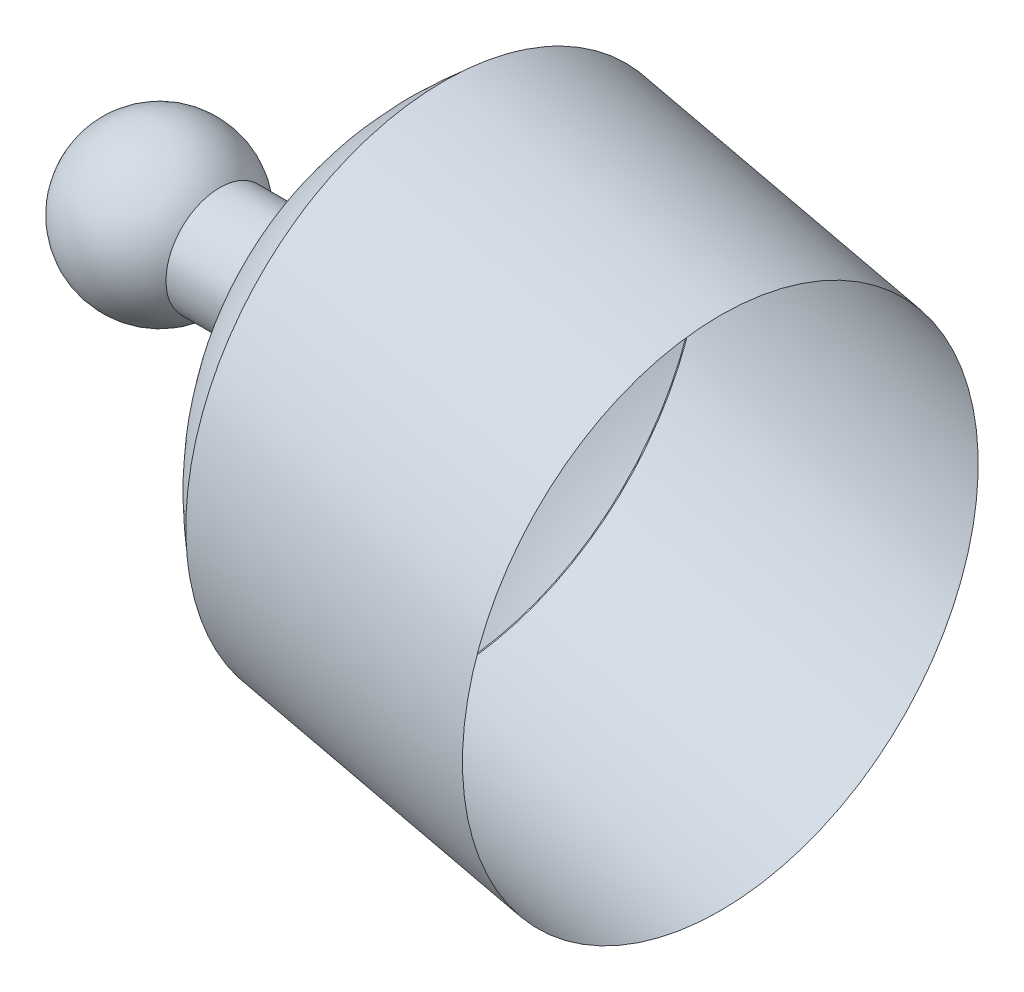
ISO-10303-21;
HEADER;
FILE_DESCRIPTION(('STEP AP214'),'2;1');
FILE_NAME('part.step','',(''),(''),'','','');
FILE_SCHEMA(('AUTOMOTIVE_DESIGN { 1 0 10303 214 1 1 1 1 }'));
ENDSEC;
DATA;
#1=APPLICATION_CONTEXT('core data for automotive mechanical design processes');
#2=APPLICATION_PROTOCOL_DEFINITION('international standard','automotive_design',2000,#1);
#3=PRODUCT_CONTEXT('',#1,'mechanical');
#4=PRODUCT('Part','Part','',(#3));
#5=PRODUCT_RELATED_PRODUCT_CATEGORY('part','',(#4));
#6=PRODUCT_DEFINITION_FORMATION('','',#4);
#7=PRODUCT_DEFINITION_CONTEXT('part definition',#1,'design');
#8=PRODUCT_DEFINITION('design','',#6,#7);
#9=PRODUCT_DEFINITION_SHAPE('','',#8);
#10=(LENGTH_UNIT() NAMED_UNIT(*) SI_UNIT(.MILLI.,.METRE.));
#11=(NAMED_UNIT(*) PLANE_ANGLE_UNIT() SI_UNIT($,.RADIAN.));
#12=(NAMED_UNIT(*) SI_UNIT($,.STERADIAN.) SOLID_ANGLE_UNIT());
#13=UNCERTAINTY_MEASURE_WITH_UNIT(LENGTH_MEASURE(1.E-05),#10,'distance_accuracy_value','');
#14=(GEOMETRIC_REPRESENTATION_CONTEXT(3) GLOBAL_UNCERTAINTY_ASSIGNED_CONTEXT((#13)) GLOBAL_UNIT_ASSIGNED_CONTEXT((#10,
#11,#12)) REPRESENTATION_CONTEXT('',''));
#15=CARTESIAN_POINT('',(0.,0.,0.));
#16=DIRECTION('',(0.,0.,1.));
#17=DIRECTION('',(1.,0.,0.));
#18=AXIS2_PLACEMENT_3D('',#15,#16,#17);
#19=CARTESIAN_POINT('',(5.56045315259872,0.0172724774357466,0.616375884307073));
#20=DIRECTION('',(-1.,0.,0.));
#21=DIRECTION('',(0.,-1.,0.));
#22=AXIS2_PLACEMENT_3D('',#19,#20,#21);
#23=CIRCLE('',#22,2.4);
#24=DIRECTION('',(-0.981835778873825,-0.00531472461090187,-0.18965826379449));
#25=VECTOR('',#24,1.);
#26=SURFACE_OF_LINEAR_EXTRUSION('',#23,#25);
#27=CARTESIAN_POINT('',(2.36955661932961,-2.4,0.));
#28=CARTESIAN_POINT('',(2.36955661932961,-2.39999350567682,0.132933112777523));
#29=CARTESIAN_POINT('',(2.36955661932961,-2.38891476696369,0.266005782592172));
#30=CARTESIAN_POINT('',(2.36955661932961,-2.34488997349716,0.528407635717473));
#31=CARTESIAN_POINT('',(2.36955661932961,-2.31194391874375,0.657736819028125));
#32=CARTESIAN_POINT('',(2.36955661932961,-2.22510079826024,0.909179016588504));
#33=CARTESIAN_POINT('',(2.36955661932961,-2.17120373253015,1.03129203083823));
#34=CARTESIAN_POINT('',(2.36955661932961,-2.04394310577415,1.26490855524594));
#35=CARTESIAN_POINT('',(2.36955661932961,-1.97057954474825,1.37641206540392));
#36=CARTESIAN_POINT('',(2.36955661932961,-1.80640994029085,1.58574094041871));
#37=CARTESIAN_POINT('',(2.36955661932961,-1.71560389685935,1.68356630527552));
#38=CARTESIAN_POINT('',(2.36955661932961,-1.51905373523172,1.86283891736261));
#39=CARTESIAN_POINT('',(2.36955661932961,-1.41330961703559,1.9442861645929));
#40=CARTESIAN_POINT('',(2.36955661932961,-1.18979991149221,2.08855660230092));
#41=CARTESIAN_POINT('',(2.36955661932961,-1.07203432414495,2.15137979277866));
#42=CARTESIAN_POINT('',(2.36955661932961,-0.827729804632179,2.25666923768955));
#43=CARTESIAN_POINT('',(2.36955661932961,-0.701190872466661,2.29913549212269));
#44=CARTESIAN_POINT('',(2.36955661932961,-0.44282978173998,2.36253982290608));
#45=CARTESIAN_POINT('',(2.36955661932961,-0.311007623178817,2.38347789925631));
#46=CARTESIAN_POINT('',(2.36955661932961,-0.0457159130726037,2.4032483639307));
#47=CARTESIAN_POINT('',(2.36955661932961,0.0877536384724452,2.40208075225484));
#48=CARTESIAN_POINT('',(2.36955661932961,0.352658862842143,2.37767204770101));
#49=CARTESIAN_POINT('',(2.36955661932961,0.484094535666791,2.35443095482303));
#50=CARTESIAN_POINT('',(2.36955661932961,0.741306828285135,2.28651630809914));
#51=CARTESIAN_POINT('',(2.36955661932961,0.867083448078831,2.24184275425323));
#52=CARTESIAN_POINT('',(2.36955661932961,1.10950854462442,2.13229534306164));
#53=CARTESIAN_POINT('',(2.36955661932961,1.22615702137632,2.06742148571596));
#54=CARTESIAN_POINT('',(2.36955661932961,1.44710850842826,1.91926277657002));
#55=CARTESIAN_POINT('',(2.36955661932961,1.55141151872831,1.83597792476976));
#56=CARTESIAN_POINT('',(2.36955661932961,1.74479525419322,1.65329433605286));
#57=CARTESIAN_POINT('',(2.36955661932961,1.83387597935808,1.55389559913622));
#58=CARTESIAN_POINT('',(2.36955661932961,1.99435817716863,1.34172579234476));
#59=CARTESIAN_POINT('',(2.36955661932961,2.06575964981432,1.22895472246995));
#60=CARTESIAN_POINT('',(2.36955661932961,2.1889139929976,0.99315062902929));
#61=CARTESIAN_POINT('',(2.36955661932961,2.24066686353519,0.870117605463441));
#62=CARTESIAN_POINT('',(2.36955661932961,2.32309658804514,0.617183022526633));
#63=CARTESIAN_POINT('',(2.36955661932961,2.3537734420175,0.487281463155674));
#64=CARTESIAN_POINT('',(2.36955661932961,2.39320502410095,0.224192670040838));
#65=CARTESIAN_POINT('',(2.36955661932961,2.40195975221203,0.0910054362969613));
#66=CARTESIAN_POINT('',(2.36955661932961,2.39730561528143,-0.174981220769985));
#67=CARTESIAN_POINT('',(2.36955661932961,2.38389675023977,-0.307780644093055));
#68=CARTESIAN_POINT('',(2.36955661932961,2.33528526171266,-0.569328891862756));
#69=CARTESIAN_POINT('',(2.36955661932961,2.30008263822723,-0.698077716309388));
#70=CARTESIAN_POINT('',(2.36955661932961,2.20885456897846,-0.947973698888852));
#71=CARTESIAN_POINT('',(2.36955661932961,2.15282912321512,-1.06912085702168));
#72=CARTESIAN_POINT('',(2.36955661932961,2.0215006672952,-1.30047210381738));
#73=CARTESIAN_POINT('',(2.36955661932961,1.94619765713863,-1.41067619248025));
#74=CARTESIAN_POINT('',(2.36955661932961,1.7783910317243,-1.6171017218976));
#75=CARTESIAN_POINT('',(2.36955661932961,1.68588741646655,-1.71332316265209));
#76=CARTESIAN_POINT('',(2.36955661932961,1.48623095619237,-1.88912947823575));
#77=CARTESIAN_POINT('',(2.36955661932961,1.37907811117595,-1.96871435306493));
#78=CARTESIAN_POINT('',(2.36955661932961,1.15307861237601,-2.10905247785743));
#79=CARTESIAN_POINT('',(2.36955661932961,1.0342319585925,-2.16980572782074));
#80=CARTESIAN_POINT('',(2.36955661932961,0.788122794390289,-2.2708049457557));
#81=CARTESIAN_POINT('',(2.36955661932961,0.660860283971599,-2.31105091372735));
#82=CARTESIAN_POINT('',(2.36955661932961,0.401429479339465,-2.36992552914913));
#83=CARTESIAN_POINT('',(2.36955661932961,0.269261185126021,-2.38855417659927));
#84=CARTESIAN_POINT('',(2.36955661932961,0.003664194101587,-2.40368034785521));
#85=CARTESIAN_POINT('',(2.36955661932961,-0.129764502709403,-2.400177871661));
#86=CARTESIAN_POINT('',(2.36955661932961,-0.394202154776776,-2.37113839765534));
#87=CARTESIAN_POINT('',(2.36955661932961,-0.525211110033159,-2.34560139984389));
#88=CARTESIAN_POINT('',(2.36955661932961,-0.781195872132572,-2.27319723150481));
#89=CARTESIAN_POINT('',(2.36955661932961,-0.906171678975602,-2.22633006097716));
#90=CARTESIAN_POINT('',(2.36955661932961,-1.14664314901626,-2.11255819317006));
#91=CARTESIAN_POINT('',(2.36955661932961,-1.26213881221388,-2.0456534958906));
#92=CARTESIAN_POINT('',(2.36955661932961,-1.48046444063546,-1.89365195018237));
#93=CARTESIAN_POINT('',(2.36955661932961,-1.58329440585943,-1.80855510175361));
#94=CARTESIAN_POINT('',(2.36955661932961,-1.77345254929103,-1.62251614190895));
#95=CARTESIAN_POINT('',(2.36955661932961,-1.86078072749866,-1.52157403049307));
#96=CARTESIAN_POINT('',(2.36955661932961,-2.01752628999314,-1.30662940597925));
#97=CARTESIAN_POINT('',(2.36955661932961,-2.08694367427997,-1.19262689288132));
#98=CARTESIAN_POINT('',(2.36955661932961,-2.20595443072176,-0.95470304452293));
#99=CARTESIAN_POINT('',(2.36955661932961,-2.25554780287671,-0.83078170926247));
#100=CARTESIAN_POINT('',(2.36955661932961,-2.3290545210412,-0.591067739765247));
#101=CARTESIAN_POINT('',(2.36955661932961,-2.35526465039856,-0.475978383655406));
#102=CARTESIAN_POINT('',(2.36955661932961,-2.38189219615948,-0.300329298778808));
#103=CARTESIAN_POINT('',(2.36955661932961,-2.38865497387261,-0.240674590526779));
#104=CARTESIAN_POINT('',(2.36955661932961,-2.39772311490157,-0.12069078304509));
#105=CARTESIAN_POINT('',(2.36955661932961,-2.40000294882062,-0.0603597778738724));
#106=CARTESIAN_POINT('',(2.36955661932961,-2.4,0.));
#107=B_SPLINE_CURVE_WITH_KNOTS('',3,(#27,#28,#29,#30,#31,#32,#33,#34,#35,#36,#37,#38,#39,#40,
#41,#42,#43,#44,#45,#46,#47,#48,#49,#50,#51,#52,#53,#54,#55,#56,#57,#58,#59,#60,#61,#62,#63,#64,
#65,#66,#67,#68,#69,#70,#71,#72,#73,#74,#75,#76,#77,#78,#79,#80,#81,#82,#83,#84,#85,#86,#87,#88,
#89,#90,#91,#92,#93,#94,#95,#96,#97,#98,#99,#100,#101,#102,#103,#104,#105,#106),.UNSPECIFIED.,
.T.,.F.,(4,2,2,2,2,2,2,2,2,2,2,2,2,2,2,2,2,2,2,2,2,2,2,2,2,2,2,2,2,2,2,2,2,2,2,2,2,2,2,4),(0.,
0.398583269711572,0.797166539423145,1.19574980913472,1.59433307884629,1.99291634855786,
2.39149961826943,2.79008288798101,3.18866615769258,3.58724942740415,3.98583269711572,
4.3844159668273,4.78299923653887,5.18158250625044,5.58016577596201,5.97874904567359,
6.37733231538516,6.77591558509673,7.1744988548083,7.57308212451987,7.97166539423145,
8.37024866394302,8.76883193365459,9.16741520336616,9.56599847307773,9.96458174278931,
10.3631650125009,10.7617482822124,11.160331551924,11.5589148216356,11.9574980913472,
12.3560813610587,12.7546646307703,13.1532479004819,13.5518311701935,13.950414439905,
14.3489977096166,14.7017591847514,14.8817185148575,15.0626997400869),.UNSPECIFIED.);
#108=CARTESIAN_POINT('',(2.36955661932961,-2.4,0.));
#109=VERTEX_POINT('',#108);
#110=EDGE_CURVE('E42',#109,#109,#107,.T.);
#111=ORIENTED_EDGE('',*,*,#110,.F.);
#112=EDGE_LOOP('',(#111));
#113=FACE_BOUND('',#112,.T.);
#114=CARTESIAN_POINT('',(5.56045315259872,-2.38272752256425,0.616375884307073));
#115=VERTEX_POINT('',#114);
#116=EDGE_CURVE('E11',#115,#115,#23,.T.);
#117=ORIENTED_EDGE('',*,*,#116,.T.);
#118=EDGE_LOOP('',(#117));
#119=FACE_BOUND('',#118,.T.);
#120=ADVANCED_FACE('F39',(#113,#119),#26,.T.);
#121=OPEN_SHELL('',(#120));
#122=SHELL_BASED_SURFACE_MODEL('B2',(#121));
#123=CARTESIAN_POINT('',(4.18493123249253,0.,0.));
#124=DIRECTION('',(1.,0.,0.));
#125=DIRECTION('',(0.,1.,0.));
#126=AXIS2_PLACEMENT_3D('',#123,#124,#125);
#127=SPHERICAL_SURFACE('',#126,3.);
#128=CARTESIAN_POINT('',(2.36955661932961,0.,0.));
#129=DIRECTION('',(1.,0.,0.));
#130=DIRECTION('',(0.,0.,-1.));
#131=AXIS2_PLACEMENT_3D('',#128,#129,#130);
#132=CIRCLE('',#131,2.38839172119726);
#133=CARTESIAN_POINT('',(2.36955661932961,0.,-2.38839172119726));
#134=VERTEX_POINT('',#133);
#135=EDGE_CURVE('E38',#134,#134,#132,.T.);
#136=ORIENTED_EDGE('',*,*,#135,.F.);
#137=EDGE_LOOP('',(#136));
#138=FACE_BOUND('',#137,.T.);
#139=ADVANCED_FACE('F76',(#138),#127,.T.);
#140=OPEN_SHELL('',(#139));
#141=SHELL_BASED_SURFACE_MODEL('B6',(#140));
#142=CARTESIAN_POINT('',(-0.274085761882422,0.,0.));
#143=DIRECTION('',(-1.,0.,0.));
#144=DIRECTION('',(0.,1.,0.));
#145=AXIS2_PLACEMENT_3D('',#142,#143,#144);
#146=SPHERICAL_SURFACE('',#145,0.75);
#147=CARTESIAN_POINT('',(0.284931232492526,0.,0.));
#148=DIRECTION('',(-1.,0.,0.));
#149=DIRECTION('',(0.,0.,1.));
#150=AXIS2_PLACEMENT_3D('',#147,#148,#149);
#151=CIRCLE('',#150,0.5);
#152=CARTESIAN_POINT('',(0.284931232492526,0.,0.5));
#153=VERTEX_POINT('',#152);
#154=EDGE_CURVE('E98',#153,#153,#151,.T.);
#155=ORIENTED_EDGE('',*,*,#154,.T.);
#156=EDGE_LOOP('',(#155));
#157=FACE_BOUND('',#156,.T.);
#158=ADVANCED_FACE('F92',(#157),#146,.T.);
#159=CARTESIAN_POINT('',(1.28493123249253,0.5,0.));
#160=DIRECTION('',(-1.,0.,0.));
#161=DIRECTION('',(0.,0.,1.));
#162=AXIS2_PLACEMENT_3D('',#159,#160,#161);
#163=PLANE('',#162);
#164=CARTESIAN_POINT('',(1.28493123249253,0.,0.));
#165=DIRECTION('',(-1.,0.,0.));
#166=DIRECTION('',(0.,0.,1.));
#167=AXIS2_PLACEMENT_3D('',#164,#165,#166);
#168=CIRCLE('',#167,0.5);
#169=CARTESIAN_POINT('',(1.28493123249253,0.,0.5));
#170=VERTEX_POINT('',#169);
#171=EDGE_CURVE('E75',#170,#170,#168,.T.);
#172=ORIENTED_EDGE('',*,*,#171,.F.);
#173=EDGE_LOOP('',(#172));
#174=FACE_BOUND('',#173,.T.);
#175=ADVANCED_FACE('F107',(#174),#163,.F.);
#176=CARTESIAN_POINT('',(-0.581094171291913,0.,0.));
#177=DIRECTION('',(-1.,0.,0.));
#178=DIRECTION('',(0.,0.,1.));
#179=AXIS2_PLACEMENT_3D('',#176,#177,#178);
#180=CYLINDRICAL_SURFACE('',#179,0.5);
#181=ORIENTED_EDGE('',*,*,#154,.F.);
#182=EDGE_LOOP('',(#181));
#183=FACE_BOUND('',#182,.T.);
#184=ORIENTED_EDGE('',*,*,#171,.T.);
#185=EDGE_LOOP('',(#184));
#186=FACE_BOUND('',#185,.T.);
#187=ADVANCED_FACE('F105',(#183,#186),#180,.T.);
#188=CLOSED_SHELL('',(#158,#175,#187));
#189=MANIFOLD_SOLID_BREP('B33',#188);
#190=ADVANCED_BREP_SHAPE_REPRESENTATION('',(#18,#189),#14);
#191=MANIFOLD_SURFACE_SHAPE_REPRESENTATION('',(#18,#122,#141),#14);
#192=SHAPE_REPRESENTATION('',(#18),#14);
#193=SHAPE_DEFINITION_REPRESENTATION(#9,#192);
#194=SHAPE_REPRESENTATION_RELATIONSHIP('','',#192,#190);
#195=SHAPE_REPRESENTATION_RELATIONSHIP('','',#192,#191);
ENDSEC;
END-ISO-10303-21;
